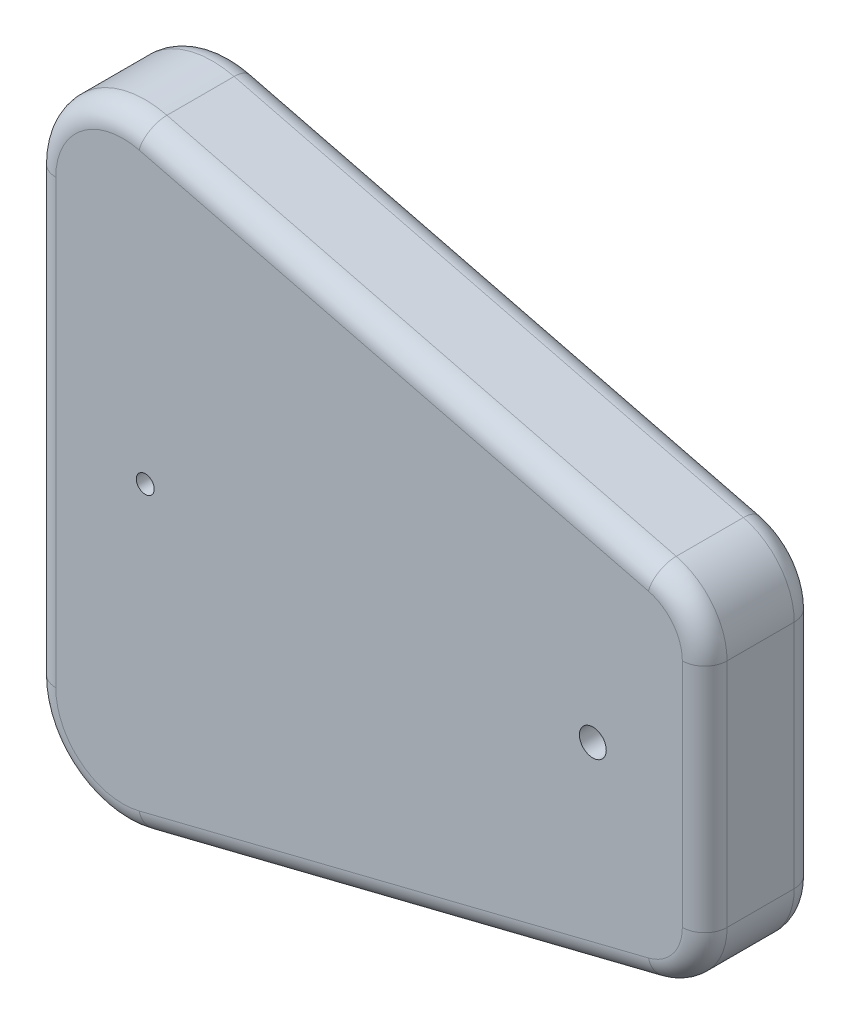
ISO-10303-21;
HEADER;
FILE_DESCRIPTION(('STEP AP214'),'2;1');
FILE_NAME('part.step','',(''),(''),'','','');
FILE_SCHEMA(('AUTOMOTIVE_DESIGN { 1 0 10303 214 1 1 1 1 }'));
ENDSEC;
DATA;
#1=APPLICATION_CONTEXT('core data for automotive mechanical design processes');
#2=APPLICATION_PROTOCOL_DEFINITION('international standard','automotive_design',2000,#1);
#3=PRODUCT_CONTEXT('',#1,'mechanical');
#4=PRODUCT('Part','Part','',(#3));
#5=PRODUCT_RELATED_PRODUCT_CATEGORY('part','',(#4));
#6=PRODUCT_DEFINITION_FORMATION('','',#4);
#7=PRODUCT_DEFINITION_CONTEXT('part definition',#1,'design');
#8=PRODUCT_DEFINITION('design','',#6,#7);
#9=PRODUCT_DEFINITION_SHAPE('','',#8);
#10=(LENGTH_UNIT() NAMED_UNIT(*) SI_UNIT(.MILLI.,.METRE.));
#11=(NAMED_UNIT(*) PLANE_ANGLE_UNIT() SI_UNIT($,.RADIAN.));
#12=(NAMED_UNIT(*) SI_UNIT($,.STERADIAN.) SOLID_ANGLE_UNIT());
#13=UNCERTAINTY_MEASURE_WITH_UNIT(LENGTH_MEASURE(1.E-05),#10,'distance_accuracy_value','');
#14=(GEOMETRIC_REPRESENTATION_CONTEXT(3) GLOBAL_UNCERTAINTY_ASSIGNED_CONTEXT((#13)) GLOBAL_UNIT_ASSIGNED_CONTEXT((#10,
#11,#12)) REPRESENTATION_CONTEXT('',''));
#15=CARTESIAN_POINT('',(0.,0.,0.));
#16=DIRECTION('',(0.,0.,1.));
#17=DIRECTION('',(1.,0.,0.));
#18=AXIS2_PLACEMENT_3D('',#15,#16,#17);
#19=CARTESIAN_POINT('',(40.,98.7689437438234,50.));
#20=DIRECTION('',(0.,0.,-1.));
#21=DIRECTION('',(-1.,0.,0.));
#22=AXIS2_PLACEMENT_3D('',#19,#20,#21);
#23=CYLINDRICAL_SURFACE('',#22,40.);
#24=DIRECTION('',(0.,0.,-1.));
#25=VECTOR('',#24,1.);
#26=CARTESIAN_POINT('',(49.7014250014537,137.574643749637,50.));
#27=LINE('',#26,#25);
#28=CARTESIAN_POINT('',(49.7014250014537,137.574643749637,40.));
#29=VERTEX_POINT('',#28);
#30=CARTESIAN_POINT('',(49.7014250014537,137.574643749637,10.));
#31=VERTEX_POINT('',#30);
#32=EDGE_CURVE('E263',#29,#31,#27,.T.);
#33=ORIENTED_EDGE('',*,*,#32,.T.);
#34=CARTESIAN_POINT('',(40.,98.7689437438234,10.));
#35=DIRECTION('',(0.,0.,-1.));
#36=DIRECTION('',(-1.,0.,0.));
#37=AXIS2_PLACEMENT_3D('',#34,#35,#36);
#38=CIRCLE('',#37,40.);
#39=CARTESIAN_POINT('',(0.,98.768943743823,10.));
#40=VERTEX_POINT('',#39);
#41=EDGE_CURVE('E228',#31,#40,#38,.F.);
#42=ORIENTED_EDGE('',*,*,#41,.T.);
#43=DIRECTION('',(0.,0.,-1.));
#44=VECTOR('',#43,1.);
#45=CARTESIAN_POINT('',(0.,98.768943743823,50.));
#46=LINE('',#45,#44);
#47=CARTESIAN_POINT('',(0.,98.768943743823,40.));
#48=VERTEX_POINT('',#47);
#49=EDGE_CURVE('E167',#48,#40,#46,.T.);
#50=ORIENTED_EDGE('',*,*,#49,.F.);
#51=CARTESIAN_POINT('',(40.,98.7689437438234,40.));
#52=DIRECTION('',(0.,0.,-1.));
#53=DIRECTION('',(-1.,0.,0.));
#54=AXIS2_PLACEMENT_3D('',#51,#52,#53);
#55=CIRCLE('',#54,40.);
#56=EDGE_CURVE('E226',#48,#29,#55,.T.);
#57=ORIENTED_EDGE('',*,*,#56,.T.);
#58=EDGE_LOOP('',(#33,#42,#50,#57));
#59=FACE_BOUND('',#58,.T.);
#60=ADVANCED_FACE('F31',(#59),#23,.T.);
#61=CARTESIAN_POINT('',(0.,-98.768943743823,50.));
#62=DIRECTION('',(1.,0.,0.));
#63=DIRECTION('',(0.,1.,0.));
#64=AXIS2_PLACEMENT_3D('',#61,#62,#63);
#65=PLANE('',#64);
#66=ORIENTED_EDGE('',*,*,#49,.T.);
#67=DIRECTION('',(0.,-1.,0.));
#68=VECTOR('',#67,1.);
#69=CARTESIAN_POINT('',(0.,-98.768943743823,10.));
#70=LINE('',#69,#68);
#71=CARTESIAN_POINT('',(0.,-98.768943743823,10.));
#72=VERTEX_POINT('',#71);
#73=EDGE_CURVE('E166',#40,#72,#70,.T.);
#74=ORIENTED_EDGE('',*,*,#73,.T.);
#75=DIRECTION('',(0.,0.,-1.));
#76=VECTOR('',#75,1.);
#77=CARTESIAN_POINT('',(0.,-98.768943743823,50.));
#78=LINE('',#77,#76);
#79=CARTESIAN_POINT('',(0.,-98.768943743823,40.));
#80=VERTEX_POINT('',#79);
#81=EDGE_CURVE('E148',#80,#72,#78,.T.);
#82=ORIENTED_EDGE('',*,*,#81,.F.);
#83=DIRECTION('',(0.,-1.,0.));
#84=VECTOR('',#83,1.);
#85=CARTESIAN_POINT('',(0.,-98.768943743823,40.));
#86=LINE('',#85,#84);
#87=EDGE_CURVE('E163',#80,#48,#86,.F.);
#88=ORIENTED_EDGE('',*,*,#87,.T.);
#89=EDGE_LOOP('',(#66,#74,#82,#88));
#90=FACE_BOUND('',#89,.T.);
#91=ADVANCED_FACE('F161',(#90),#65,.F.);
#92=CARTESIAN_POINT('',(39.9999999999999,-98.7689437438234,50.));
#93=DIRECTION('',(0.,0.,-1.));
#94=DIRECTION('',(-1.,0.,0.));
#95=AXIS2_PLACEMENT_3D('',#92,#93,#94);
#96=CYLINDRICAL_SURFACE('',#95,40.);
#97=ORIENTED_EDGE('',*,*,#81,.T.);
#98=CARTESIAN_POINT('',(39.9999999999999,-98.7689437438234,10.));
#99=DIRECTION('',(0.,0.,-1.));
#100=DIRECTION('',(-1.,0.,0.));
#101=AXIS2_PLACEMENT_3D('',#98,#99,#100);
#102=CIRCLE('',#101,40.);
#103=CARTESIAN_POINT('',(49.7014250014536,-137.574643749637,10.));
#104=VERTEX_POINT('',#103);
#105=EDGE_CURVE('E155',#72,#104,#102,.F.);
#106=ORIENTED_EDGE('',*,*,#105,.T.);
#107=DIRECTION('',(0.,0.,-1.));
#108=VECTOR('',#107,1.);
#109=CARTESIAN_POINT('',(49.7014250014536,-137.574643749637,50.));
#110=LINE('',#109,#108);
#111=CARTESIAN_POINT('',(49.7014250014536,-137.574643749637,40.));
#112=VERTEX_POINT('',#111);
#113=EDGE_CURVE('E150',#112,#104,#110,.T.);
#114=ORIENTED_EDGE('',*,*,#113,.F.);
#115=CARTESIAN_POINT('',(39.9999999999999,-98.7689437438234,40.));
#116=DIRECTION('',(0.,0.,-1.));
#117=DIRECTION('',(-1.,0.,0.));
#118=AXIS2_PLACEMENT_3D('',#115,#116,#117);
#119=CIRCLE('',#118,40.);
#120=EDGE_CURVE('E145',#112,#80,#119,.T.);
#121=ORIENTED_EDGE('',*,*,#120,.T.);
#122=EDGE_LOOP('',(#97,#106,#114,#121));
#123=FACE_BOUND('',#122,.T.);
#124=ADVANCED_FACE('F147',(#123),#96,.T.);
#125=CARTESIAN_POINT('',(49.7014250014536,-137.574643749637,50.));
#126=DIRECTION('',(-0.242535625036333,0.970142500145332,0.));
#127=DIRECTION('',(-0.970142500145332,-0.242535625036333,0.));
#128=AXIS2_PLACEMENT_3D('',#125,#126,#127);
#129=PLANE('',#128);
#130=ORIENTED_EDGE('',*,*,#113,.T.);
#131=DIRECTION('',(0.970142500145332,0.242535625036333,0.));
#132=VECTOR('',#131,1.);
#133=CARTESIAN_POINT('',(277.27606875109,-80.6809828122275,10.));
#134=LINE('',#133,#132);
#135=CARTESIAN_POINT('',(277.27606875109,-80.6809828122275,10.));
#136=VERTEX_POINT('',#135);
#137=EDGE_CURVE('E207',#104,#136,#134,.T.);
#138=ORIENTED_EDGE('',*,*,#137,.T.);
#139=DIRECTION('',(0.,0.,-1.));
#140=VECTOR('',#139,1.);
#141=CARTESIAN_POINT('',(277.27606875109,-80.6809828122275,50.));
#142=LINE('',#141,#140);
#143=CARTESIAN_POINT('',(277.27606875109,-80.6809828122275,40.));
#144=VERTEX_POINT('',#143);
#145=EDGE_CURVE('E289',#144,#136,#142,.T.);
#146=ORIENTED_EDGE('',*,*,#145,.F.);
#147=DIRECTION('',(0.970142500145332,0.242535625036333,0.));
#148=VECTOR('',#147,1.);
#149=CARTESIAN_POINT('',(49.7014250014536,-137.574643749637,40.));
#150=LINE('',#149,#148);
#151=EDGE_CURVE('E205',#144,#112,#150,.F.);
#152=ORIENTED_EDGE('',*,*,#151,.T.);
#153=EDGE_LOOP('',(#130,#138,#146,#152));
#154=FACE_BOUND('',#153,.T.);
#155=ADVANCED_FACE('F286',(#154),#129,.F.);
#156=CARTESIAN_POINT('',(270.,-51.5767078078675,50.));
#157=DIRECTION('',(0.,0.,-1.));
#158=DIRECTION('',(-1.,0.,0.));
#159=AXIS2_PLACEMENT_3D('',#156,#157,#158);
#160=CYLINDRICAL_SURFACE('',#159,30.);
#161=ORIENTED_EDGE('',*,*,#145,.T.);
#162=CARTESIAN_POINT('',(270.,-51.5767078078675,10.));
#163=DIRECTION('',(0.,0.,-1.));
#164=DIRECTION('',(-1.,0.,0.));
#165=AXIS2_PLACEMENT_3D('',#162,#163,#164);
#166=CIRCLE('',#165,30.);
#167=CARTESIAN_POINT('',(300.,-51.5767078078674,10.));
#168=VERTEX_POINT('',#167);
#169=EDGE_CURVE('E211',#136,#168,#166,.F.);
#170=ORIENTED_EDGE('',*,*,#169,.T.);
#171=DIRECTION('',(0.,0.,-1.));
#172=VECTOR('',#171,1.);
#173=CARTESIAN_POINT('',(300.,-51.5767078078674,50.));
#174=LINE('',#173,#172);
#175=CARTESIAN_POINT('',(300.,-51.5767078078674,40.));
#176=VERTEX_POINT('',#175);
#177=EDGE_CURVE('E292',#176,#168,#174,.T.);
#178=ORIENTED_EDGE('',*,*,#177,.F.);
#179=CARTESIAN_POINT('',(270.,-51.5767078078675,40.));
#180=DIRECTION('',(0.,0.,-1.));
#181=DIRECTION('',(-1.,0.,0.));
#182=AXIS2_PLACEMENT_3D('',#179,#180,#181);
#183=CIRCLE('',#182,30.);
#184=EDGE_CURVE('E209',#176,#144,#183,.T.);
#185=ORIENTED_EDGE('',*,*,#184,.T.);
#186=EDGE_LOOP('',(#161,#170,#178,#185));
#187=FACE_BOUND('',#186,.T.);
#188=ADVANCED_FACE('F477',(#187),#160,.T.);
#189=CARTESIAN_POINT('',(300.,51.5767078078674,50.));
#190=DIRECTION('',(-1.,0.,0.));
#191=DIRECTION('',(0.,-1.,0.));
#192=AXIS2_PLACEMENT_3D('',#189,#190,#191);
#193=PLANE('',#192);
#194=ORIENTED_EDGE('',*,*,#177,.T.);
#195=DIRECTION('',(0.,1.,0.));
#196=VECTOR('',#195,1.);
#197=CARTESIAN_POINT('',(300.,51.5767078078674,10.));
#198=LINE('',#197,#196);
#199=CARTESIAN_POINT('',(300.,51.5767078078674,10.));
#200=VERTEX_POINT('',#199);
#201=EDGE_CURVE('E215',#168,#200,#198,.T.);
#202=ORIENTED_EDGE('',*,*,#201,.T.);
#203=DIRECTION('',(0.,0.,-1.));
#204=VECTOR('',#203,1.);
#205=CARTESIAN_POINT('',(300.,51.5767078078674,50.));
#206=LINE('',#205,#204);
#207=CARTESIAN_POINT('',(300.,51.5767078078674,40.));
#208=VERTEX_POINT('',#207);
#209=EDGE_CURVE('E296',#208,#200,#206,.T.);
#210=ORIENTED_EDGE('',*,*,#209,.F.);
#211=DIRECTION('',(0.,1.,0.));
#212=VECTOR('',#211,1.);
#213=CARTESIAN_POINT('',(300.,51.5767078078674,40.));
#214=LINE('',#213,#212);
#215=EDGE_CURVE('E213',#208,#176,#214,.F.);
#216=ORIENTED_EDGE('',*,*,#215,.T.);
#217=EDGE_LOOP('',(#194,#202,#210,#216));
#218=FACE_BOUND('',#217,.T.);
#219=ADVANCED_FACE('F469',(#218),#193,.F.);
#220=CARTESIAN_POINT('',(270.,51.5767078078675,50.));
#221=DIRECTION('',(0.,0.,-1.));
#222=DIRECTION('',(-1.,0.,0.));
#223=AXIS2_PLACEMENT_3D('',#220,#221,#222);
#224=CYLINDRICAL_SURFACE('',#223,30.);
#225=ORIENTED_EDGE('',*,*,#209,.T.);
#226=CARTESIAN_POINT('',(270.,51.5767078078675,10.));
#227=DIRECTION('',(0.,0.,-1.));
#228=DIRECTION('',(-1.,0.,0.));
#229=AXIS2_PLACEMENT_3D('',#226,#227,#228);
#230=CIRCLE('',#229,30.);
#231=CARTESIAN_POINT('',(277.27606875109,80.6809828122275,10.));
#232=VERTEX_POINT('',#231);
#233=EDGE_CURVE('E219',#200,#232,#230,.F.);
#234=ORIENTED_EDGE('',*,*,#233,.T.);
#235=DIRECTION('',(0.,0.,-1.));
#236=VECTOR('',#235,1.);
#237=CARTESIAN_POINT('',(277.27606875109,80.6809828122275,50.));
#238=LINE('',#237,#236);
#239=CARTESIAN_POINT('',(277.27606875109,80.6809828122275,40.));
#240=VERTEX_POINT('',#239);
#241=EDGE_CURVE('E301',#240,#232,#238,.T.);
#242=ORIENTED_EDGE('',*,*,#241,.F.);
#243=CARTESIAN_POINT('',(270.,51.5767078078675,40.));
#244=DIRECTION('',(0.,0.,-1.));
#245=DIRECTION('',(-1.,0.,0.));
#246=AXIS2_PLACEMENT_3D('',#243,#244,#245);
#247=CIRCLE('',#246,30.);
#248=EDGE_CURVE('E217',#240,#208,#247,.T.);
#249=ORIENTED_EDGE('',*,*,#248,.T.);
#250=EDGE_LOOP('',(#225,#234,#242,#249));
#251=FACE_BOUND('',#250,.T.);
#252=ADVANCED_FACE('F461',(#251),#224,.T.);
#253=CARTESIAN_POINT('',(49.7014250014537,137.574643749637,50.));
#254=DIRECTION('',(-0.242535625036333,-0.970142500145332,0.));
#255=DIRECTION('',(0.970142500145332,-0.242535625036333,0.));
#256=AXIS2_PLACEMENT_3D('',#253,#254,#255);
#257=PLANE('',#256);
#258=ORIENTED_EDGE('',*,*,#241,.T.);
#259=DIRECTION('',(-0.970142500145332,0.242535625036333,0.));
#260=VECTOR('',#259,1.);
#261=CARTESIAN_POINT('',(49.7014250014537,137.574643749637,10.));
#262=LINE('',#261,#260);
#263=EDGE_CURVE('E224',#232,#31,#262,.T.);
#264=ORIENTED_EDGE('',*,*,#263,.T.);
#265=ORIENTED_EDGE('',*,*,#32,.F.);
#266=DIRECTION('',(-0.970142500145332,0.242535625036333,0.));
#267=VECTOR('',#266,1.);
#268=CARTESIAN_POINT('',(49.7014250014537,137.574643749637,40.));
#269=LINE('',#268,#267);
#270=EDGE_CURVE('E221',#29,#240,#269,.F.);
#271=ORIENTED_EDGE('',*,*,#270,.T.);
#272=EDGE_LOOP('',(#258,#264,#265,#271));
#273=FACE_BOUND('',#272,.T.);
#274=ADVANCED_FACE('F331',(#273),#257,.F.);
#275=CARTESIAN_POINT('',(40.,98.7689437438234,50.));
#276=DIRECTION('',(0.,0.,-1.));
#277=DIRECTION('',(-1.,0.,0.));
#278=AXIS2_PLACEMENT_3D('',#275,#276,#277);
#279=PLANE('',#278);
#280=CARTESIAN_POINT('',(250.,0.,50.));
#281=DIRECTION('',(0.,0.,1.));
#282=DIRECTION('',(1.,0.,0.));
#283=AXIS2_PLACEMENT_3D('',#280,#281,#282);
#284=CIRCLE('',#283,5.99999999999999);
#285=CARTESIAN_POINT('',(256.,0.,50.));
#286=VERTEX_POINT('',#285);
#287=EDGE_CURVE('E312',#286,#286,#284,.T.);
#288=ORIENTED_EDGE('',*,*,#287,.F.);
#289=EDGE_LOOP('',(#288));
#290=FACE_BOUND('',#289,.T.);
#291=CARTESIAN_POINT('',(50.,0.,50.));
#292=DIRECTION('',(0.,0.,1.));
#293=DIRECTION('',(1.,0.,0.));
#294=AXIS2_PLACEMENT_3D('',#291,#292,#293);
#295=CIRCLE('',#294,4.00000000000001);
#296=CARTESIAN_POINT('',(54.,0.,50.));
#297=VERTEX_POINT('',#296);
#298=EDGE_CURVE('E306',#297,#297,#295,.T.);
#299=ORIENTED_EDGE('',*,*,#298,.F.);
#300=EDGE_LOOP('',(#299));
#301=FACE_BOUND('',#300,.T.);
#302=CARTESIAN_POINT('',(270.,51.5767078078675,50.));
#303=DIRECTION('',(0.,0.,-1.));
#304=DIRECTION('',(-1.,0.,0.));
#305=AXIS2_PLACEMENT_3D('',#302,#303,#304);
#306=CIRCLE('',#305,20.);
#307=CARTESIAN_POINT('',(290.,51.5767078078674,50.));
#308=VERTEX_POINT('',#307);
#309=CARTESIAN_POINT('',(274.850712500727,70.9795578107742,50.));
#310=VERTEX_POINT('',#309);
#311=EDGE_CURVE('E40',#308,#310,#306,.F.);
#312=ORIENTED_EDGE('',*,*,#311,.T.);
#313=DIRECTION('',(-0.970142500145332,0.242535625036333,0.));
#314=VECTOR('',#313,1.);
#315=CARTESIAN_POINT('',(47.27606875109,127.873218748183,50.));
#316=LINE('',#315,#314);
#317=CARTESIAN_POINT('',(47.2760687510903,127.873218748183,50.));
#318=VERTEX_POINT('',#317);
#319=EDGE_CURVE('E11',#310,#318,#316,.T.);
#320=ORIENTED_EDGE('',*,*,#319,.T.);
#321=CARTESIAN_POINT('',(40.,98.7689437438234,50.));
#322=DIRECTION('',(0.,0.,-1.));
#323=DIRECTION('',(-1.,0.,0.));
#324=AXIS2_PLACEMENT_3D('',#321,#322,#323);
#325=CIRCLE('',#324,30.);
#326=CARTESIAN_POINT('',(10.,98.768943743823,50.));
#327=VERTEX_POINT('',#326);
#328=EDGE_CURVE('E230',#318,#327,#325,.F.);
#329=ORIENTED_EDGE('',*,*,#328,.T.);
#330=DIRECTION('',(0.,-1.,0.));
#331=VECTOR('',#330,1.);
#332=CARTESIAN_POINT('',(10.,98.7689437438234,50.));
#333=LINE('',#332,#331);
#334=CARTESIAN_POINT('',(9.99999999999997,-98.7689437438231,50.));
#335=VERTEX_POINT('',#334);
#336=EDGE_CURVE('E232',#327,#335,#333,.T.);
#337=ORIENTED_EDGE('',*,*,#336,.T.);
#338=CARTESIAN_POINT('',(39.9999999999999,-98.7689437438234,50.));
#339=DIRECTION('',(0.,0.,-1.));
#340=DIRECTION('',(-1.,0.,0.));
#341=AXIS2_PLACEMENT_3D('',#338,#339,#340);
#342=CIRCLE('',#341,30.);
#343=CARTESIAN_POINT('',(47.2760687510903,-127.873218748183,50.));
#344=VERTEX_POINT('',#343);
#345=EDGE_CURVE('E173',#335,#344,#342,.F.);
#346=ORIENTED_EDGE('',*,*,#345,.T.);
#347=DIRECTION('',(0.970142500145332,0.242535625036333,0.));
#348=VECTOR('',#347,1.);
#349=CARTESIAN_POINT('',(93.7555716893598,-116.253343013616,50.));
#350=LINE('',#349,#348);
#351=CARTESIAN_POINT('',(274.850712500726,-70.9795578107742,50.));
#352=VERTEX_POINT('',#351);
#353=EDGE_CURVE('E235',#344,#352,#350,.T.);
#354=ORIENTED_EDGE('',*,*,#353,.T.);
#355=CARTESIAN_POINT('',(270.,-51.5767078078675,50.));
#356=DIRECTION('',(0.,0.,-1.));
#357=DIRECTION('',(-1.,0.,0.));
#358=AXIS2_PLACEMENT_3D('',#355,#356,#357);
#359=CIRCLE('',#358,20.);
#360=CARTESIAN_POINT('',(290.,-51.5767078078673,50.));
#361=VERTEX_POINT('',#360);
#362=EDGE_CURVE('E237',#352,#361,#359,.F.);
#363=ORIENTED_EDGE('',*,*,#362,.T.);
#364=DIRECTION('',(0.,1.,0.));
#365=VECTOR('',#364,1.);
#366=CARTESIAN_POINT('',(290.,98.7689437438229,50.));
#367=LINE('',#366,#365);
#368=EDGE_CURVE('E51',#361,#308,#367,.T.);
#369=ORIENTED_EDGE('',*,*,#368,.T.);
#370=EDGE_LOOP('',(#312,#320,#329,#337,#346,#354,#363,#369));
#371=FACE_BOUND('',#370,.T.);
#372=ADVANCED_FACE('F327',(#290,#301,#371),#279,.F.);
#373=CARTESIAN_POINT('',(40.,98.7689437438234,0.));
#374=DIRECTION('',(0.,0.,-1.));
#375=DIRECTION('',(-1.,0.,0.));
#376=AXIS2_PLACEMENT_3D('',#373,#374,#375);
#377=PLANE('',#376);
#378=CARTESIAN_POINT('',(39.9999999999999,-98.7689437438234,0.));
#379=DIRECTION('',(0.,0.,-1.));
#380=DIRECTION('',(-1.,0.,0.));
#381=AXIS2_PLACEMENT_3D('',#378,#379,#380);
#382=CIRCLE('',#381,30.);
#383=CARTESIAN_POINT('',(47.2760687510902,-127.873218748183,0.));
#384=VERTEX_POINT('',#383);
#385=CARTESIAN_POINT('',(9.99999999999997,-98.768943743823,0.));
#386=VERTEX_POINT('',#385);
#387=EDGE_CURVE('E200',#384,#386,#382,.T.);
#388=ORIENTED_EDGE('',*,*,#387,.T.);
#389=DIRECTION('',(0.,-1.,0.));
#390=VECTOR('',#389,1.);
#391=CARTESIAN_POINT('',(10.,98.768943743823,0.));
#392=LINE('',#391,#390);
#393=CARTESIAN_POINT('',(10.,98.768943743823,0.));
#394=VERTEX_POINT('',#393);
#395=EDGE_CURVE('E156',#386,#394,#392,.F.);
#396=ORIENTED_EDGE('',*,*,#395,.T.);
#397=CARTESIAN_POINT('',(40.,98.7689437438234,0.));
#398=DIRECTION('',(0.,0.,-1.));
#399=DIRECTION('',(-1.,0.,0.));
#400=AXIS2_PLACEMENT_3D('',#397,#398,#399);
#401=CIRCLE('',#400,30.);
#402=CARTESIAN_POINT('',(47.2760687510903,127.873218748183,0.));
#403=VERTEX_POINT('',#402);
#404=EDGE_CURVE('E185',#394,#403,#401,.T.);
#405=ORIENTED_EDGE('',*,*,#404,.T.);
#406=DIRECTION('',(-0.970142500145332,0.242535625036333,0.));
#407=VECTOR('',#406,1.);
#408=CARTESIAN_POINT('',(274.850712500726,70.9795578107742,0.));
#409=LINE('',#408,#407);
#410=CARTESIAN_POINT('',(274.850712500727,70.9795578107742,0.));
#411=VERTEX_POINT('',#410);
#412=EDGE_CURVE('E190',#403,#411,#409,.F.);
#413=ORIENTED_EDGE('',*,*,#412,.T.);
#414=CARTESIAN_POINT('',(270.,51.5767078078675,0.));
#415=DIRECTION('',(0.,0.,-1.));
#416=DIRECTION('',(-1.,0.,0.));
#417=AXIS2_PLACEMENT_3D('',#414,#415,#416);
#418=CIRCLE('',#417,20.);
#419=CARTESIAN_POINT('',(290.,51.5767078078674,0.));
#420=VERTEX_POINT('',#419);
#421=EDGE_CURVE('E192',#411,#420,#418,.T.);
#422=ORIENTED_EDGE('',*,*,#421,.T.);
#423=DIRECTION('',(0.,1.,0.));
#424=VECTOR('',#423,1.);
#425=CARTESIAN_POINT('',(290.,-51.5767078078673,0.));
#426=LINE('',#425,#424);
#427=CARTESIAN_POINT('',(290.,-51.5767078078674,0.));
#428=VERTEX_POINT('',#427);
#429=EDGE_CURVE('E194',#420,#428,#426,.F.);
#430=ORIENTED_EDGE('',*,*,#429,.T.);
#431=CARTESIAN_POINT('',(270.,-51.5767078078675,0.));
#432=DIRECTION('',(0.,0.,-1.));
#433=DIRECTION('',(-1.,0.,0.));
#434=AXIS2_PLACEMENT_3D('',#431,#432,#433);
#435=CIRCLE('',#434,20.);
#436=CARTESIAN_POINT('',(274.850712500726,-70.9795578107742,0.));
#437=VERTEX_POINT('',#436);
#438=EDGE_CURVE('E196',#428,#437,#435,.T.);
#439=ORIENTED_EDGE('',*,*,#438,.T.);
#440=DIRECTION('',(0.970142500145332,0.242535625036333,0.));
#441=VECTOR('',#440,1.);
#442=CARTESIAN_POINT('',(47.2760687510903,-127.873218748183,0.));
#443=LINE('',#442,#441);
#444=EDGE_CURVE('E198',#437,#384,#443,.F.);
#445=ORIENTED_EDGE('',*,*,#444,.T.);
#446=EDGE_LOOP('',(#388,#396,#405,#413,#422,#430,#439,#445));
#447=FACE_BOUND('',#446,.T.);
#448=ADVANCED_FACE('F330',(#447),#377,.T.);
#449=CARTESIAN_POINT('',(290.,51.5767078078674,10.));
#450=DIRECTION('',(0.,-1.,0.));
#451=DIRECTION('',(1.,0.,0.));
#452=AXIS2_PLACEMENT_3D('',#449,#450,#451);
#453=CYLINDRICAL_SURFACE('',#452,10.);
#454=CARTESIAN_POINT('',(290.,-51.5767078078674,10.));
#455=DIRECTION('',(0.,-1.,0.));
#456=DIRECTION('',(1.,0.,0.));
#457=AXIS2_PLACEMENT_3D('',#454,#455,#456);
#458=CIRCLE('',#457,10.);
#459=EDGE_CURVE('E257',#428,#168,#458,.T.);
#460=ORIENTED_EDGE('',*,*,#459,.F.);
#461=ORIENTED_EDGE('',*,*,#429,.F.);
#462=CARTESIAN_POINT('',(290.,51.5767078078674,10.));
#463=DIRECTION('',(0.,1.,0.));
#464=DIRECTION('',(-1.,0.,0.));
#465=AXIS2_PLACEMENT_3D('',#462,#463,#464);
#466=CIRCLE('',#465,10.);
#467=EDGE_CURVE('E260',#200,#420,#466,.T.);
#468=ORIENTED_EDGE('',*,*,#467,.F.);
#469=ORIENTED_EDGE('',*,*,#201,.F.);
#470=EDGE_LOOP('',(#460,#461,#468,#469));
#471=FACE_BOUND('',#470,.T.);
#472=ADVANCED_FACE('F386',(#471),#453,.T.);
#473=CARTESIAN_POINT('',(270.,51.5767078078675,10.));
#474=DIRECTION('',(0.,0.,-1.));
#475=DIRECTION('',(-1.,0.,0.));
#476=AXIS2_PLACEMENT_3D('',#473,#474,#475);
#477=TOROIDAL_SURFACE('',#476,20.,10.);
#478=ORIENTED_EDGE('',*,*,#467,.T.);
#479=ORIENTED_EDGE('',*,*,#421,.F.);
#480=CARTESIAN_POINT('',(274.850712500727,70.9795578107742,10.));
#481=DIRECTION('',(-0.970142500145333,0.242535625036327,0.));
#482=DIRECTION('',(-0.242535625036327,-0.970142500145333,0.));
#483=AXIS2_PLACEMENT_3D('',#480,#481,#482);
#484=CIRCLE('',#483,10.);
#485=EDGE_CURVE('E254',#232,#411,#484,.T.);
#486=ORIENTED_EDGE('',*,*,#485,.F.);
#487=ORIENTED_EDGE('',*,*,#233,.F.);
#488=EDGE_LOOP('',(#478,#479,#486,#487));
#489=FACE_BOUND('',#488,.T.);
#490=ADVANCED_FACE('F382',(#489),#477,.T.);
#491=CARTESIAN_POINT('',(270.,-51.5767078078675,10.));
#492=DIRECTION('',(0.,0.,-1.));
#493=DIRECTION('',(-1.,0.,0.));
#494=AXIS2_PLACEMENT_3D('',#491,#492,#493);
#495=TOROIDAL_SURFACE('',#494,20.,10.);
#496=ORIENTED_EDGE('',*,*,#459,.T.);
#497=ORIENTED_EDGE('',*,*,#169,.F.);
#498=CARTESIAN_POINT('',(274.850712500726,-70.9795578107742,10.));
#499=DIRECTION('',(-0.970142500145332,-0.242535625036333,0.));
#500=DIRECTION('',(0.242535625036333,-0.970142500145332,0.));
#501=AXIS2_PLACEMENT_3D('',#498,#499,#500);
#502=CIRCLE('',#501,10.);
#503=EDGE_CURVE('E251',#437,#136,#502,.T.);
#504=ORIENTED_EDGE('',*,*,#503,.F.);
#505=ORIENTED_EDGE('',*,*,#438,.F.);
#506=EDGE_LOOP('',(#496,#497,#504,#505));
#507=FACE_BOUND('',#506,.T.);
#508=ADVANCED_FACE('F378',(#507),#495,.T.);
#509=CARTESIAN_POINT('',(47.2760687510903,127.873218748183,10.));
#510=DIRECTION('',(0.970142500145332,-0.242535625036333,0.));
#511=DIRECTION('',(0.242535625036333,0.970142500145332,0.));
#512=AXIS2_PLACEMENT_3D('',#509,#510,#511);
#513=CYLINDRICAL_SURFACE('',#512,10.);
#514=ORIENTED_EDGE('',*,*,#485,.T.);
#515=ORIENTED_EDGE('',*,*,#412,.F.);
#516=CARTESIAN_POINT('',(47.2760687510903,127.873218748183,10.));
#517=DIRECTION('',(-0.970142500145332,0.242535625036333,0.));
#518=DIRECTION('',(-0.242535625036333,-0.970142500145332,0.));
#519=AXIS2_PLACEMENT_3D('',#516,#517,#518);
#520=CIRCLE('',#519,10.);
#521=EDGE_CURVE('E248',#31,#403,#520,.T.);
#522=ORIENTED_EDGE('',*,*,#521,.F.);
#523=ORIENTED_EDGE('',*,*,#263,.F.);
#524=EDGE_LOOP('',(#514,#515,#522,#523));
#525=FACE_BOUND('',#524,.T.);
#526=ADVANCED_FACE('F374',(#525),#513,.T.);
#527=CARTESIAN_POINT('',(47.2760687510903,-127.873218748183,10.));
#528=DIRECTION('',(-0.970142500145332,-0.242535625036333,0.));
#529=DIRECTION('',(0.242535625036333,-0.970142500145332,0.));
#530=AXIS2_PLACEMENT_3D('',#527,#528,#529);
#531=CYLINDRICAL_SURFACE('',#530,10.);
#532=ORIENTED_EDGE('',*,*,#503,.T.);
#533=ORIENTED_EDGE('',*,*,#137,.F.);
#534=CARTESIAN_POINT('',(47.2760687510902,-127.873218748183,10.));
#535=DIRECTION('',(-0.97014250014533,-0.242535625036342,0.));
#536=DIRECTION('',(0.242535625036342,-0.97014250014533,0.));
#537=AXIS2_PLACEMENT_3D('',#534,#535,#536);
#538=CIRCLE('',#537,10.);
#539=EDGE_CURVE('E245',#384,#104,#538,.T.);
#540=ORIENTED_EDGE('',*,*,#539,.F.);
#541=ORIENTED_EDGE('',*,*,#444,.F.);
#542=EDGE_LOOP('',(#532,#533,#540,#541));
#543=FACE_BOUND('',#542,.T.);
#544=ADVANCED_FACE('F370',(#543),#531,.T.);
#545=CARTESIAN_POINT('',(40.,98.7689437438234,10.));
#546=DIRECTION('',(0.,0.,-1.));
#547=DIRECTION('',(-1.,0.,0.));
#548=AXIS2_PLACEMENT_3D('',#545,#546,#547);
#549=TOROIDAL_SURFACE('',#548,30.,10.);
#550=ORIENTED_EDGE('',*,*,#521,.T.);
#551=ORIENTED_EDGE('',*,*,#404,.F.);
#552=CARTESIAN_POINT('',(10.,98.7689437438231,10.));
#553=DIRECTION('',(0.,-1.,0.));
#554=DIRECTION('',(0.,0.,-1.));
#555=AXIS2_PLACEMENT_3D('',#552,#553,#554);
#556=CIRCLE('',#555,10.);
#557=EDGE_CURVE('E243',#40,#394,#556,.T.);
#558=ORIENTED_EDGE('',*,*,#557,.F.);
#559=ORIENTED_EDGE('',*,*,#41,.F.);
#560=EDGE_LOOP('',(#550,#551,#558,#559));
#561=FACE_BOUND('',#560,.T.);
#562=ADVANCED_FACE('F366',(#561),#549,.T.);
#563=CARTESIAN_POINT('',(39.9999999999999,-98.7689437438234,10.));
#564=DIRECTION('',(0.,0.,-1.));
#565=DIRECTION('',(-1.,0.,0.));
#566=AXIS2_PLACEMENT_3D('',#563,#564,#565);
#567=TOROIDAL_SURFACE('',#566,30.,10.);
#568=ORIENTED_EDGE('',*,*,#539,.T.);
#569=ORIENTED_EDGE('',*,*,#105,.F.);
#570=CARTESIAN_POINT('',(9.99999999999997,-98.768943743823,10.));
#571=DIRECTION('',(0.,1.,0.));
#572=DIRECTION('',(0.,0.,1.));
#573=AXIS2_PLACEMENT_3D('',#570,#571,#572);
#574=CIRCLE('',#573,10.);
#575=EDGE_CURVE('E241',#386,#72,#574,.T.);
#576=ORIENTED_EDGE('',*,*,#575,.F.);
#577=ORIENTED_EDGE('',*,*,#387,.F.);
#578=EDGE_LOOP('',(#568,#569,#576,#577));
#579=FACE_BOUND('',#578,.T.);
#580=ADVANCED_FACE('F362',(#579),#567,.T.);
#581=CARTESIAN_POINT('',(9.99999999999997,-98.768943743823,10.));
#582=DIRECTION('',(0.,1.,0.));
#583=DIRECTION('',(-1.,0.,0.));
#584=AXIS2_PLACEMENT_3D('',#581,#582,#583);
#585=CYLINDRICAL_SURFACE('',#584,10.);
#586=ORIENTED_EDGE('',*,*,#557,.T.);
#587=ORIENTED_EDGE('',*,*,#395,.F.);
#588=ORIENTED_EDGE('',*,*,#575,.T.);
#589=ORIENTED_EDGE('',*,*,#73,.F.);
#590=EDGE_LOOP('',(#586,#587,#588,#589));
#591=FACE_BOUND('',#590,.T.);
#592=ADVANCED_FACE('F359',(#591),#585,.T.);
#593=CARTESIAN_POINT('',(93.7555716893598,-116.253343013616,40.));
#594=DIRECTION('',(0.970142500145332,0.242535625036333,0.));
#595=DIRECTION('',(-0.242535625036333,0.970142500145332,0.));
#596=AXIS2_PLACEMENT_3D('',#593,#594,#595);
#597=CYLINDRICAL_SURFACE('',#596,10.);
#598=CARTESIAN_POINT('',(47.2760687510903,-127.873218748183,40.));
#599=DIRECTION('',(-0.970142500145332,-0.242535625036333,0.));
#600=DIRECTION('',(0.242535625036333,-0.970142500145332,0.));
#601=AXIS2_PLACEMENT_3D('',#598,#599,#600);
#602=CIRCLE('',#601,10.);
#603=EDGE_CURVE('E273',#112,#344,#602,.T.);
#604=ORIENTED_EDGE('',*,*,#603,.F.);
#605=ORIENTED_EDGE('',*,*,#151,.F.);
#606=CARTESIAN_POINT('',(274.850712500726,-70.9795578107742,40.));
#607=DIRECTION('',(0.970142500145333,0.242535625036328,0.));
#608=DIRECTION('',(-0.242535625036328,0.970142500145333,0.));
#609=AXIS2_PLACEMENT_3D('',#606,#607,#608);
#610=CIRCLE('',#609,10.);
#611=EDGE_CURVE('E35',#352,#144,#610,.T.);
#612=ORIENTED_EDGE('',*,*,#611,.F.);
#613=ORIENTED_EDGE('',*,*,#353,.F.);
#614=EDGE_LOOP('',(#604,#605,#612,#613));
#615=FACE_BOUND('',#614,.T.);
#616=ADVANCED_FACE('F33',(#615),#597,.T.);
#617=CARTESIAN_POINT('',(270.,-51.5767078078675,40.));
#618=DIRECTION('',(0.,0.,-1.));
#619=DIRECTION('',(-1.,0.,0.));
#620=AXIS2_PLACEMENT_3D('',#617,#618,#619);
#621=TOROIDAL_SURFACE('',#620,20.,10.);
#622=ORIENTED_EDGE('',*,*,#611,.T.);
#623=ORIENTED_EDGE('',*,*,#184,.F.);
#624=CARTESIAN_POINT('',(290.,-51.5767078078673,40.));
#625=DIRECTION('',(0.,1.,0.));
#626=DIRECTION('',(-1.,0.,0.));
#627=AXIS2_PLACEMENT_3D('',#624,#625,#626);
#628=CIRCLE('',#627,10.);
#629=EDGE_CURVE('E176',#361,#176,#628,.T.);
#630=ORIENTED_EDGE('',*,*,#629,.F.);
#631=ORIENTED_EDGE('',*,*,#362,.F.);
#632=EDGE_LOOP('',(#622,#623,#630,#631));
#633=FACE_BOUND('',#632,.T.);
#634=ADVANCED_FACE('F279',(#633),#621,.T.);
#635=CARTESIAN_POINT('',(39.9999999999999,-98.7689437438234,40.));
#636=DIRECTION('',(0.,0.,-1.));
#637=DIRECTION('',(-1.,0.,0.));
#638=AXIS2_PLACEMENT_3D('',#635,#636,#637);
#639=TOROIDAL_SURFACE('',#638,30.,10.);
#640=ORIENTED_EDGE('',*,*,#603,.T.);
#641=ORIENTED_EDGE('',*,*,#345,.F.);
#642=CARTESIAN_POINT('',(9.99999999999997,-98.7689437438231,40.));
#643=DIRECTION('',(0.,1.,0.));
#644=DIRECTION('',(-1.,0.,0.));
#645=AXIS2_PLACEMENT_3D('',#642,#643,#644);
#646=CIRCLE('',#645,10.);
#647=EDGE_CURVE('E171',#80,#335,#646,.T.);
#648=ORIENTED_EDGE('',*,*,#647,.F.);
#649=ORIENTED_EDGE('',*,*,#120,.F.);
#650=EDGE_LOOP('',(#640,#641,#648,#649));
#651=FACE_BOUND('',#650,.T.);
#652=ADVANCED_FACE('F172',(#651),#639,.T.);
#653=CARTESIAN_POINT('',(290.,98.7689437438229,40.));
#654=DIRECTION('',(0.,1.,0.));
#655=DIRECTION('',(-1.,0.,0.));
#656=AXIS2_PLACEMENT_3D('',#653,#654,#655);
#657=CYLINDRICAL_SURFACE('',#656,10.);
#658=ORIENTED_EDGE('',*,*,#629,.T.);
#659=ORIENTED_EDGE('',*,*,#215,.F.);
#660=CARTESIAN_POINT('',(290.,51.5767078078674,40.));
#661=DIRECTION('',(0.,1.,0.));
#662=DIRECTION('',(-1.,0.,0.));
#663=AXIS2_PLACEMENT_3D('',#660,#661,#662);
#664=CIRCLE('',#663,10.);
#665=EDGE_CURVE('E177',#308,#208,#664,.T.);
#666=ORIENTED_EDGE('',*,*,#665,.F.);
#667=ORIENTED_EDGE('',*,*,#368,.F.);
#668=EDGE_LOOP('',(#658,#659,#666,#667));
#669=FACE_BOUND('',#668,.T.);
#670=ADVANCED_FACE('F400',(#669),#657,.T.);
#671=CARTESIAN_POINT('',(10.,98.7689437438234,40.));
#672=DIRECTION('',(0.,-1.,0.));
#673=DIRECTION('',(1.,0.,0.));
#674=AXIS2_PLACEMENT_3D('',#671,#672,#673);
#675=CYLINDRICAL_SURFACE('',#674,10.);
#676=ORIENTED_EDGE('',*,*,#647,.T.);
#677=ORIENTED_EDGE('',*,*,#336,.F.);
#678=CARTESIAN_POINT('',(10.,98.768943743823,40.));
#679=DIRECTION('',(0.,1.,0.));
#680=DIRECTION('',(0.,0.,1.));
#681=AXIS2_PLACEMENT_3D('',#678,#679,#680);
#682=CIRCLE('',#681,10.);
#683=EDGE_CURVE('E182',#48,#327,#682,.T.);
#684=ORIENTED_EDGE('',*,*,#683,.F.);
#685=ORIENTED_EDGE('',*,*,#87,.F.);
#686=EDGE_LOOP('',(#676,#677,#684,#685));
#687=FACE_BOUND('',#686,.T.);
#688=ADVANCED_FACE('F180',(#687),#675,.T.);
#689=CARTESIAN_POINT('',(270.,51.5767078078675,40.));
#690=DIRECTION('',(0.,0.,-1.));
#691=DIRECTION('',(-1.,0.,0.));
#692=AXIS2_PLACEMENT_3D('',#689,#690,#691);
#693=TOROIDAL_SURFACE('',#692,20.,10.);
#694=ORIENTED_EDGE('',*,*,#665,.T.);
#695=ORIENTED_EDGE('',*,*,#248,.F.);
#696=CARTESIAN_POINT('',(274.850712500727,70.9795578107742,40.));
#697=DIRECTION('',(-0.970142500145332,0.242535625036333,0.));
#698=DIRECTION('',(-0.242535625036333,-0.970142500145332,0.));
#699=AXIS2_PLACEMENT_3D('',#696,#697,#698);
#700=CIRCLE('',#699,10.);
#701=EDGE_CURVE('E266',#310,#240,#700,.T.);
#702=ORIENTED_EDGE('',*,*,#701,.F.);
#703=ORIENTED_EDGE('',*,*,#311,.F.);
#704=EDGE_LOOP('',(#694,#695,#702,#703));
#705=FACE_BOUND('',#704,.T.);
#706=ADVANCED_FACE('F393',(#705),#693,.T.);
#707=CARTESIAN_POINT('',(40.,98.7689437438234,40.));
#708=DIRECTION('',(0.,0.,-1.));
#709=DIRECTION('',(-1.,0.,0.));
#710=AXIS2_PLACEMENT_3D('',#707,#708,#709);
#711=TOROIDAL_SURFACE('',#710,30.,10.);
#712=ORIENTED_EDGE('',*,*,#683,.T.);
#713=ORIENTED_EDGE('',*,*,#328,.F.);
#714=CARTESIAN_POINT('',(47.2760687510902,127.873218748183,40.));
#715=DIRECTION('',(0.970142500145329,-0.242535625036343,0.));
#716=DIRECTION('',(0.242535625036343,0.970142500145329,0.));
#717=AXIS2_PLACEMENT_3D('',#714,#715,#716);
#718=CIRCLE('',#717,10.);
#719=EDGE_CURVE('E264',#29,#318,#718,.T.);
#720=ORIENTED_EDGE('',*,*,#719,.F.);
#721=ORIENTED_EDGE('',*,*,#56,.F.);
#722=EDGE_LOOP('',(#712,#713,#720,#721));
#723=FACE_BOUND('',#722,.T.);
#724=ADVANCED_FACE('F346',(#723),#711,.T.);
#725=CARTESIAN_POINT('',(47.27606875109,127.873218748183,40.));
#726=DIRECTION('',(-0.970142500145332,0.242535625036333,0.));
#727=DIRECTION('',(-0.242535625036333,-0.970142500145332,0.));
#728=AXIS2_PLACEMENT_3D('',#725,#726,#727);
#729=CYLINDRICAL_SURFACE('',#728,10.);
#730=ORIENTED_EDGE('',*,*,#701,.T.);
#731=ORIENTED_EDGE('',*,*,#270,.F.);
#732=ORIENTED_EDGE('',*,*,#719,.T.);
#733=ORIENTED_EDGE('',*,*,#319,.F.);
#734=EDGE_LOOP('',(#730,#731,#732,#733));
#735=FACE_BOUND('',#734,.T.);
#736=ADVANCED_FACE('F337',(#735),#729,.T.);
#737=CARTESIAN_POINT('',(50.,0.,20.));
#738=DIRECTION('',(0.,0.,1.));
#739=DIRECTION('',(1.,0.,0.));
#740=AXIS2_PLACEMENT_3D('',#737,#738,#739);
#741=CYLINDRICAL_SURFACE('',#740,4.00000000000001);
#742=CARTESIAN_POINT('',(50.,0.,20.));
#743=DIRECTION('',(0.,0.,1.));
#744=DIRECTION('',(1.,0.,0.));
#745=AXIS2_PLACEMENT_3D('',#742,#743,#744);
#746=CIRCLE('',#745,4.00000000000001);
#747=CARTESIAN_POINT('',(54.,0.,20.));
#748=VERTEX_POINT('',#747);
#749=EDGE_CURVE('E267',#748,#748,#746,.T.);
#750=ORIENTED_EDGE('',*,*,#749,.F.);
#751=EDGE_LOOP('',(#750));
#752=FACE_BOUND('',#751,.T.);
#753=ORIENTED_EDGE('',*,*,#298,.T.);
#754=EDGE_LOOP('',(#753));
#755=FACE_BOUND('',#754,.T.);
#756=ADVANCED_FACE('F335',(#752,#755),#741,.F.);
#757=CARTESIAN_POINT('',(50.,0.,20.));
#758=DIRECTION('',(0.,0.,1.));
#759=DIRECTION('',(1.,0.,0.));
#760=AXIS2_PLACEMENT_3D('',#757,#758,#759);
#761=PLANE('',#760);
#762=ORIENTED_EDGE('',*,*,#749,.T.);
#763=EDGE_LOOP('',(#762));
#764=FACE_BOUND('',#763,.T.);
#765=ADVANCED_FACE('F323',(#764),#761,.T.);
#766=CARTESIAN_POINT('',(250.,0.,20.));
#767=DIRECTION('',(0.,0.,1.));
#768=DIRECTION('',(1.,0.,0.));
#769=AXIS2_PLACEMENT_3D('',#766,#767,#768);
#770=CYLINDRICAL_SURFACE('',#769,5.99999999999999);
#771=CARTESIAN_POINT('',(250.,0.,20.));
#772=DIRECTION('',(0.,0.,1.));
#773=DIRECTION('',(1.,0.,0.));
#774=AXIS2_PLACEMENT_3D('',#771,#772,#773);
#775=CIRCLE('',#774,5.99999999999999);
#776=CARTESIAN_POINT('',(256.,0.,20.));
#777=VERTEX_POINT('',#776);
#778=EDGE_CURVE('E309',#777,#777,#775,.T.);
#779=ORIENTED_EDGE('',*,*,#778,.F.);
#780=EDGE_LOOP('',(#779));
#781=FACE_BOUND('',#780,.T.);
#782=ORIENTED_EDGE('',*,*,#287,.T.);
#783=EDGE_LOOP('',(#782));
#784=FACE_BOUND('',#783,.T.);
#785=ADVANCED_FACE('F320',(#781,#784),#770,.F.);
#786=CARTESIAN_POINT('',(250.,0.,20.));
#787=DIRECTION('',(0.,0.,1.));
#788=DIRECTION('',(1.,0.,0.));
#789=AXIS2_PLACEMENT_3D('',#786,#787,#788);
#790=PLANE('',#789);
#791=ORIENTED_EDGE('',*,*,#778,.T.);
#792=EDGE_LOOP('',(#791));
#793=FACE_BOUND('',#792,.T.);
#794=ADVANCED_FACE('F318',(#793),#790,.T.);
#795=CLOSED_SHELL('',(#60,#91,#124,#155,#188,#219,#252,#274,#372,#448,#472,#490,#508,#526,#544,
#562,#580,#592,#616,#634,#652,#670,#688,#706,#724,#736,#756,#765,#785,#794));
#796=MANIFOLD_SOLID_BREP('B2',#795);
#797=ADVANCED_BREP_SHAPE_REPRESENTATION('',(#18,#796),#14);
#798=SHAPE_DEFINITION_REPRESENTATION(#9,#797);
ENDSEC;
END-ISO-10303-21;
